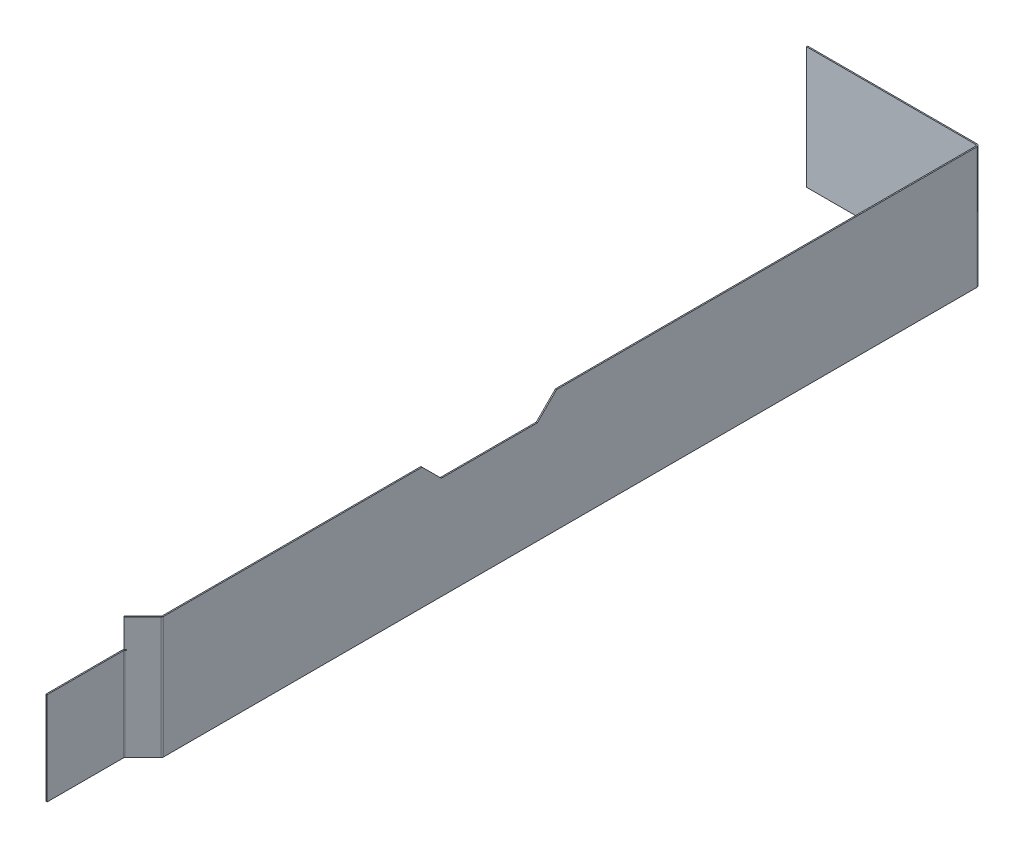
ISO-10303-21;
HEADER;
FILE_DESCRIPTION(('STEP AP214'),'2;1');
FILE_NAME('part.step','',(''),(''),'','','');
FILE_SCHEMA(('AUTOMOTIVE_DESIGN { 1 0 10303 214 1 1 1 1 }'));
ENDSEC;
DATA;
#1=APPLICATION_CONTEXT('core data for automotive mechanical design processes');
#2=APPLICATION_PROTOCOL_DEFINITION('international standard','automotive_design',2000,#1);
#3=PRODUCT_CONTEXT('',#1,'mechanical');
#4=PRODUCT('Part','Part','',(#3));
#5=PRODUCT_RELATED_PRODUCT_CATEGORY('part','',(#4));
#6=PRODUCT_DEFINITION_FORMATION('','',#4);
#7=PRODUCT_DEFINITION_CONTEXT('part definition',#1,'design');
#8=PRODUCT_DEFINITION('design','',#6,#7);
#9=PRODUCT_DEFINITION_SHAPE('','',#8);
#10=(LENGTH_UNIT() NAMED_UNIT(*) SI_UNIT(.MILLI.,.METRE.));
#11=(NAMED_UNIT(*) PLANE_ANGLE_UNIT() SI_UNIT($,.RADIAN.));
#12=(NAMED_UNIT(*) SI_UNIT($,.STERADIAN.) SOLID_ANGLE_UNIT());
#13=UNCERTAINTY_MEASURE_WITH_UNIT(LENGTH_MEASURE(1.E-05),#10,'distance_accuracy_value','');
#14=(GEOMETRIC_REPRESENTATION_CONTEXT(3) GLOBAL_UNCERTAINTY_ASSIGNED_CONTEXT((#13)) GLOBAL_UNIT_ASSIGNED_CONTEXT((#10,
#11,#12)) REPRESENTATION_CONTEXT('',''));
#15=CARTESIAN_POINT('',(0.,0.,0.));
#16=DIRECTION('',(0.,0.,1.));
#17=DIRECTION('',(1.,0.,0.));
#18=AXIS2_PLACEMENT_3D('',#15,#16,#17);
#19=CARTESIAN_POINT('',(-206.259115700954,1.45603603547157,-50.1060746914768));
#20=DIRECTION('',(0.,1.,0.));
#21=DIRECTION('',(-1.,0.,0.));
#22=AXIS2_PLACEMENT_3D('',#19,#20,#21);
#23=PLANE('',#22);
#24=DIRECTION('',(1.,0.,0.));
#25=VECTOR('',#24,1.);
#26=CARTESIAN_POINT('',(98.5408842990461,1.45603603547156,-48.5820746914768));
#27=LINE('',#26,#25);
#28=CARTESIAN_POINT('',(95.0102842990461,1.45603603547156,-48.5820746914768));
#29=VERTEX_POINT('',#28);
#30=CARTESIAN_POINT('',(-128.535115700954,1.45603603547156,-48.5820746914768));
#31=VERTEX_POINT('',#30);
#32=EDGE_CURVE('E190',#29,#31,#27,.F.);
#33=ORIENTED_EDGE('',*,*,#32,.T.);
#34=DIRECTION('',(0.,0.,1.));
#35=VECTOR('',#34,1.);
#36=CARTESIAN_POINT('',(-128.535115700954,1.45603603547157,-50.1060746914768));
#37=LINE('',#36,#35);
#38=CARTESIAN_POINT('',(-128.535115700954,1.45603603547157,-50.1060746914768));
#39=VERTEX_POINT('',#38);
#40=EDGE_CURVE('E54',#31,#39,#37,.F.);
#41=ORIENTED_EDGE('',*,*,#40,.T.);
#42=DIRECTION('',(-1.,0.,0.));
#43=VECTOR('',#42,1.);
#44=CARTESIAN_POINT('',(-206.259115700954,1.45603603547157,-50.1060746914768));
#45=LINE('',#44,#43);
#46=CARTESIAN_POINT('',(95.0102842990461,1.45603603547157,-50.1060746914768));
#47=VERTEX_POINT('',#46);
#48=EDGE_CURVE('E335',#47,#39,#45,.T.);
#49=ORIENTED_EDGE('',*,*,#48,.F.);
#50=DIRECTION('',(0.,0.,-1.));
#51=VECTOR('',#50,1.);
#52=CARTESIAN_POINT('',(95.0102842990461,1.45603603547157,-50.1060746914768));
#53=LINE('',#52,#51);
#54=EDGE_CURVE('E285',#29,#47,#53,.T.);
#55=ORIENTED_EDGE('',*,*,#54,.F.);
#56=EDGE_LOOP('',(#33,#41,#49,#55));
#57=FACE_BOUND('',#56,.T.);
#58=ADVANCED_FACE('F39',(#57),#23,.F.);
#59=CARTESIAN_POINT('',(98.5408842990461,162.314236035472,-50.1060746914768));
#60=DIRECTION('',(0.,1.,0.));
#61=DIRECTION('',(-1.,0.,0.));
#62=AXIS2_PLACEMENT_3D('',#59,#60,#61);
#63=PLANE('',#62);
#64=DIRECTION('',(-1.,0.,0.));
#65=VECTOR('',#64,1.);
#66=CARTESIAN_POINT('',(98.5408842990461,162.314236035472,-50.1060746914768));
#67=LINE('',#66,#65);
#68=CARTESIAN_POINT('',(95.0102842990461,162.314236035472,-50.1060746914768));
#69=VERTEX_POINT('',#68);
#70=CARTESIAN_POINT('',(-128.535115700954,162.314236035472,-50.1060746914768));
#71=VERTEX_POINT('',#70);
#72=EDGE_CURVE('E398',#69,#71,#67,.T.);
#73=ORIENTED_EDGE('',*,*,#72,.T.);
#74=DIRECTION('',(0.,0.,1.));
#75=VECTOR('',#74,1.);
#76=CARTESIAN_POINT('',(-128.535115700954,162.314236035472,-50.1060746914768));
#77=LINE('',#76,#75);
#78=CARTESIAN_POINT('',(-128.535115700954,162.314236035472,-48.5820746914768));
#79=VERTEX_POINT('',#78);
#80=EDGE_CURVE('E962',#71,#79,#77,.T.);
#81=ORIENTED_EDGE('',*,*,#80,.T.);
#82=DIRECTION('',(1.,0.,0.));
#83=VECTOR('',#82,1.);
#84=CARTESIAN_POINT('',(98.5408842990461,162.314236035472,-48.5820746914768));
#85=LINE('',#84,#83);
#86=CARTESIAN_POINT('',(95.0102842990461,162.314236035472,-48.5820746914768));
#87=VERTEX_POINT('',#86);
#88=EDGE_CURVE('E227',#87,#79,#85,.F.);
#89=ORIENTED_EDGE('',*,*,#88,.F.);
#90=DIRECTION('',(0.,0.,-1.));
#91=VECTOR('',#90,1.);
#92=CARTESIAN_POINT('',(95.0102842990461,162.314236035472,-50.1060746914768));
#93=LINE('',#92,#91);
#94=EDGE_CURVE('E282',#87,#69,#93,.T.);
#95=ORIENTED_EDGE('',*,*,#94,.T.);
#96=EDGE_LOOP('',(#73,#81,#89,#95));
#97=FACE_BOUND('',#96,.T.);
#98=ADVANCED_FACE('F395',(#97),#63,.T.);
#99=CARTESIAN_POINT('',(98.5408842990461,162.314236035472,-50.1060746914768));
#100=DIRECTION('',(0.,0.,1.));
#101=DIRECTION('',(1.,0.,0.));
#102=AXIS2_PLACEMENT_3D('',#99,#100,#101);
#103=PLANE('',#102);
#104=DIRECTION('',(0.,-1.,0.));
#105=VECTOR('',#104,1.);
#106=CARTESIAN_POINT('',(-128.535115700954,162.314236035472,-50.1060746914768));
#107=LINE('',#106,#105);
#108=EDGE_CURVE('E234',#71,#39,#107,.T.);
#109=ORIENTED_EDGE('',*,*,#108,.F.);
#110=ORIENTED_EDGE('',*,*,#72,.F.);
#111=DIRECTION('',(0.,-1.,0.));
#112=VECTOR('',#111,1.);
#113=CARTESIAN_POINT('',(95.0102842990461,162.314236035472,-50.1060746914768));
#114=LINE('',#113,#112);
#115=EDGE_CURVE('E340',#69,#47,#114,.T.);
#116=ORIENTED_EDGE('',*,*,#115,.T.);
#117=ORIENTED_EDGE('',*,*,#48,.T.);
#118=EDGE_LOOP('',(#109,#110,#116,#117));
#119=FACE_BOUND('',#118,.T.);
#120=ADVANCED_FACE('F401',(#119),#103,.F.);
#121=CARTESIAN_POINT('',(98.5408842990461,162.314236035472,-48.5820746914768));
#122=DIRECTION('',(0.,0.,1.));
#123=DIRECTION('',(1.,0.,0.));
#124=AXIS2_PLACEMENT_3D('',#121,#122,#123);
#125=PLANE('',#124);
#126=ORIENTED_EDGE('',*,*,#88,.T.);
#127=DIRECTION('',(0.,-1.,0.));
#128=VECTOR('',#127,1.);
#129=CARTESIAN_POINT('',(-128.535115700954,162.314236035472,-48.5820746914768));
#130=LINE('',#129,#128);
#131=EDGE_CURVE('E11',#79,#31,#130,.T.);
#132=ORIENTED_EDGE('',*,*,#131,.T.);
#133=ORIENTED_EDGE('',*,*,#32,.F.);
#134=DIRECTION('',(0.,1.,0.));
#135=VECTOR('',#134,1.);
#136=CARTESIAN_POINT('',(95.0102842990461,162.314236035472,-48.5820746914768));
#137=LINE('',#136,#135);
#138=EDGE_CURVE('E186',#87,#29,#137,.F.);
#139=ORIENTED_EDGE('',*,*,#138,.F.);
#140=EDGE_LOOP('',(#126,#132,#133,#139));
#141=FACE_BOUND('',#140,.T.);
#142=ADVANCED_FACE('F372',(#141),#125,.T.);
#143=CARTESIAN_POINT('',(73.1408842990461,1.45603603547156,1054.79392530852));
#144=DIRECTION('',(0.,1.,0.));
#145=DIRECTION('',(0.707106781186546,0.,-0.707106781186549));
#146=AXIS2_PLACEMENT_3D('',#143,#144,#145);
#147=PLANE('',#146);
#148=DIRECTION('',(0.707106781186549,0.,0.707106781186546));
#149=VECTOR('',#148,1.);
#150=CARTESIAN_POINT('',(73.7286038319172,1.45603603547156,1054.20620577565));
#151=LINE('',#150,#149);
#152=CARTESIAN_POINT('',(72.6509730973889,1.45603603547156,1053.12857504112));
#153=VERTEX_POINT('',#152);
#154=CARTESIAN_POINT('',(73.7286038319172,1.45603603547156,1054.20620577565));
#155=VERTEX_POINT('',#154);
#156=EDGE_CURVE('E47',#153,#155,#151,.T.);
#157=ORIENTED_EDGE('',*,*,#156,.F.);
#158=DIRECTION('',(-0.707106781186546,0.,0.707106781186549));
#159=VECTOR('',#158,1.);
#160=CARTESIAN_POINT('',(72.0632535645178,1.45603603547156,1053.71629457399));
#161=LINE('',#160,#159);
#162=CARTESIAN_POINT('',(96.4291647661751,1.45603603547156,1029.35038337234));
#163=VERTEX_POINT('',#162);
#164=EDGE_CURVE('E204',#153,#163,#161,.F.);
#165=ORIENTED_EDGE('',*,*,#164,.T.);
#166=DIRECTION('',(0.707106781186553,0.,0.707106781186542));
#167=VECTOR('',#166,1.);
#168=CARTESIAN_POINT('',(97.5067955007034,1.45603603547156,1030.42801410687));
#169=LINE('',#168,#167);
#170=CARTESIAN_POINT('',(97.5067955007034,1.45603603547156,1030.42801410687));
#171=VERTEX_POINT('',#170);
#172=EDGE_CURVE('E293',#163,#171,#169,.T.);
#173=ORIENTED_EDGE('',*,*,#172,.T.);
#174=DIRECTION('',(0.707106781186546,0.,-0.707106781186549));
#175=VECTOR('',#174,1.);
#176=CARTESIAN_POINT('',(73.1408842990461,1.45603603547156,1054.79392530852));
#177=LINE('',#176,#175);
#178=EDGE_CURVE('E313',#155,#171,#177,.T.);
#179=ORIENTED_EDGE('',*,*,#178,.F.);
#180=EDGE_LOOP('',(#157,#165,#173,#179));
#181=FACE_BOUND('',#180,.T.);
#182=ADVANCED_FACE('F314',(#181),#147,.F.);
#183=CARTESIAN_POINT('',(95.0102842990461,1.45603603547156,1027.93150290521));
#184=DIRECTION('',(0.,1.,0.));
#185=DIRECTION('',(0.,0.,1.));
#186=AXIS2_PLACEMENT_3D('',#183,#184,#185);
#187=PLANE('',#186);
#188=ORIENTED_EDGE('',*,*,#172,.F.);
#189=CARTESIAN_POINT('',(95.0102842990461,1.45603603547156,1027.93150290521));
#190=DIRECTION('',(0.,-1.,0.));
#191=DIRECTION('',(0.,0.,-1.));
#192=AXIS2_PLACEMENT_3D('',#189,#190,#191);
#193=CIRCLE('',#192,2.0066);
#194=CARTESIAN_POINT('',(97.0168842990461,1.45603603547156,1027.93150290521));
#195=VERTEX_POINT('',#194);
#196=EDGE_CURVE('E207',#163,#195,#193,.F.);
#197=ORIENTED_EDGE('',*,*,#196,.T.);
#198=DIRECTION('',(1.,0.,0.));
#199=VECTOR('',#198,1.);
#200=CARTESIAN_POINT('',(98.5408842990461,1.45603603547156,1027.93150290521));
#201=LINE('',#200,#199);
#202=CARTESIAN_POINT('',(98.5408842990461,1.45603603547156,1027.93150290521));
#203=VERTEX_POINT('',#202);
#204=EDGE_CURVE('E290',#195,#203,#201,.T.);
#205=ORIENTED_EDGE('',*,*,#204,.T.);
#206=CARTESIAN_POINT('',(95.0102842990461,1.45603603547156,1027.93150290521));
#207=DIRECTION('',(0.,-1.,0.));
#208=DIRECTION('',(0.,0.,-1.));
#209=AXIS2_PLACEMENT_3D('',#206,#207,#208);
#210=CIRCLE('',#209,3.5306);
#211=EDGE_CURVE('E341',#171,#203,#210,.F.);
#212=ORIENTED_EDGE('',*,*,#211,.F.);
#213=EDGE_LOOP('',(#188,#197,#205,#212));
#214=FACE_BOUND('',#213,.T.);
#215=ADVANCED_FACE('F522',(#214),#187,.F.);
#216=CARTESIAN_POINT('',(98.5408842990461,1.45603603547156,1029.39392530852));
#217=DIRECTION('',(0.,1.,0.));
#218=DIRECTION('',(0.,0.,-1.));
#219=AXIS2_PLACEMENT_3D('',#216,#217,#218);
#220=PLANE('',#219);
#221=ORIENTED_EDGE('',*,*,#204,.F.);
#222=DIRECTION('',(0.,0.,1.));
#223=VECTOR('',#222,1.);
#224=CARTESIAN_POINT('',(97.0168842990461,1.45603603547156,1029.39392530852));
#225=LINE('',#224,#223);
#226=CARTESIAN_POINT('',(97.0168842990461,1.45603603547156,-46.5754746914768));
#227=VERTEX_POINT('',#226);
#228=EDGE_CURVE('E223',#195,#227,#225,.F.);
#229=ORIENTED_EDGE('',*,*,#228,.T.);
#230=DIRECTION('',(1.,0.,0.));
#231=VECTOR('',#230,1.);
#232=CARTESIAN_POINT('',(98.5408842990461,1.45603603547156,-46.5754746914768));
#233=LINE('',#232,#231);
#234=CARTESIAN_POINT('',(98.5408842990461,1.45603603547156,-46.5754746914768));
#235=VERTEX_POINT('',#234);
#236=EDGE_CURVE('E288',#227,#235,#233,.T.);
#237=ORIENTED_EDGE('',*,*,#236,.T.);
#238=DIRECTION('',(0.,0.,-1.));
#239=VECTOR('',#238,1.);
#240=CARTESIAN_POINT('',(98.5408842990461,1.45603603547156,1029.39392530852));
#241=LINE('',#240,#239);
#242=EDGE_CURVE('E403',#203,#235,#241,.T.);
#243=ORIENTED_EDGE('',*,*,#242,.F.);
#244=EDGE_LOOP('',(#221,#229,#237,#243));
#245=FACE_BOUND('',#244,.T.);
#246=ADVANCED_FACE('F519',(#245),#220,.F.);
#247=CARTESIAN_POINT('',(95.0102842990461,1.45603603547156,-46.5754746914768));
#248=DIRECTION('',(0.,1.,0.));
#249=DIRECTION('',(0.,0.,1.));
#250=AXIS2_PLACEMENT_3D('',#247,#248,#249);
#251=PLANE('',#250);
#252=ORIENTED_EDGE('',*,*,#236,.F.);
#253=CARTESIAN_POINT('',(95.0102842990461,1.45603603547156,-46.5754746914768));
#254=DIRECTION('',(0.,-1.,0.));
#255=DIRECTION('',(0.,0.,-1.));
#256=AXIS2_PLACEMENT_3D('',#253,#254,#255);
#257=CIRCLE('',#256,2.0066);
#258=EDGE_CURVE('E226',#227,#29,#257,.F.);
#259=ORIENTED_EDGE('',*,*,#258,.T.);
#260=ORIENTED_EDGE('',*,*,#54,.T.);
#261=CARTESIAN_POINT('',(95.0102842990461,1.45603603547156,-46.5754746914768));
#262=DIRECTION('',(0.,-1.,0.));
#263=DIRECTION('',(0.,0.,-1.));
#264=AXIS2_PLACEMENT_3D('',#261,#262,#263);
#265=CIRCLE('',#264,3.5306);
#266=EDGE_CURVE('E351',#235,#47,#265,.F.);
#267=ORIENTED_EDGE('',*,*,#266,.F.);
#268=EDGE_LOOP('',(#252,#259,#260,#267));
#269=FACE_BOUND('',#268,.T.);
#270=ADVANCED_FACE('F375',(#269),#251,.F.);
#271=CARTESIAN_POINT('',(95.0102842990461,162.314236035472,-46.5754746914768));
#272=DIRECTION('',(0.,-1.,0.));
#273=DIRECTION('',(0.,0.,-1.));
#274=AXIS2_PLACEMENT_3D('',#271,#272,#273);
#275=PLANE('',#274);
#276=ORIENTED_EDGE('',*,*,#94,.F.);
#277=CARTESIAN_POINT('',(95.0102842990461,162.314236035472,-46.5754746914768));
#278=DIRECTION('',(0.,-1.,0.));
#279=DIRECTION('',(0.,0.,-1.));
#280=AXIS2_PLACEMENT_3D('',#277,#278,#279);
#281=CIRCLE('',#280,2.0066);
#282=CARTESIAN_POINT('',(97.0168842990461,162.314236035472,-46.5754746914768));
#283=VERTEX_POINT('',#282);
#284=EDGE_CURVE('E224',#87,#283,#281,.T.);
#285=ORIENTED_EDGE('',*,*,#284,.T.);
#286=DIRECTION('',(1.,0.,0.));
#287=VECTOR('',#286,1.);
#288=CARTESIAN_POINT('',(98.5408842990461,162.314236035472,-46.5754746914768));
#289=LINE('',#288,#287);
#290=CARTESIAN_POINT('',(98.5408842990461,162.314236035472,-46.5754746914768));
#291=VERTEX_POINT('',#290);
#292=EDGE_CURVE('E62',#283,#291,#289,.T.);
#293=ORIENTED_EDGE('',*,*,#292,.T.);
#294=CARTESIAN_POINT('',(95.0102842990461,162.314236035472,-46.5754746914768));
#295=DIRECTION('',(0.,1.,0.));
#296=DIRECTION('',(0.,0.,1.));
#297=AXIS2_PLACEMENT_3D('',#294,#295,#296);
#298=CIRCLE('',#297,3.5306);
#299=EDGE_CURVE('E344',#69,#291,#298,.F.);
#300=ORIENTED_EDGE('',*,*,#299,.F.);
#301=EDGE_LOOP('',(#276,#285,#293,#300));
#302=FACE_BOUND('',#301,.T.);
#303=ADVANCED_FACE('F390',(#302),#275,.F.);
#304=CARTESIAN_POINT('',(98.5408842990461,162.314236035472,1029.39392530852));
#305=DIRECTION('',(0.,1.,0.));
#306=DIRECTION('',(0.,0.,-1.));
#307=AXIS2_PLACEMENT_3D('',#304,#305,#306);
#308=PLANE('',#307);
#309=ORIENTED_EDGE('',*,*,#292,.F.);
#310=DIRECTION('',(0.,0.,1.));
#311=VECTOR('',#310,1.);
#312=CARTESIAN_POINT('',(97.0168842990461,162.314236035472,1029.39392530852));
#313=LINE('',#312,#311);
#314=CARTESIAN_POINT('',(97.0168842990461,162.314236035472,508.693925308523));
#315=VERTEX_POINT('',#314);
#316=EDGE_CURVE('E220',#315,#283,#313,.F.);
#317=ORIENTED_EDGE('',*,*,#316,.F.);
#318=DIRECTION('',(1.,0.,0.));
#319=VECTOR('',#318,1.);
#320=CARTESIAN_POINT('',(98.5408842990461,162.314236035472,508.693925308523));
#321=LINE('',#320,#319);
#322=CARTESIAN_POINT('',(98.5408842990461,162.314236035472,508.693925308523));
#323=VERTEX_POINT('',#322);
#324=EDGE_CURVE('E278',#315,#323,#321,.T.);
#325=ORIENTED_EDGE('',*,*,#324,.T.);
#326=DIRECTION('',(0.,0.,-1.));
#327=VECTOR('',#326,1.);
#328=CARTESIAN_POINT('',(98.5408842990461,162.314236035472,1029.39392530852));
#329=LINE('',#328,#327);
#330=EDGE_CURVE('E405',#323,#291,#329,.T.);
#331=ORIENTED_EDGE('',*,*,#330,.T.);
#332=EDGE_LOOP('',(#309,#317,#325,#331));
#333=FACE_BOUND('',#332,.T.);
#334=ADVANCED_FACE('F832',(#333),#308,.T.);
#335=CARTESIAN_POINT('',(98.5408842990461,-98.0357639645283,769.043925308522));
#336=DIRECTION('',(0.,-0.707106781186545,-0.70710678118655));
#337=DIRECTION('',(0.,-0.70710678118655,0.707106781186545));
#338=AXIS2_PLACEMENT_3D('',#335,#336,#337);
#339=PLANE('',#338);
#340=ORIENTED_EDGE('',*,*,#324,.F.);
#341=DIRECTION('',(0.,-0.70710678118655,0.707106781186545));
#342=VECTOR('',#341,1.);
#343=CARTESIAN_POINT('',(97.0168842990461,-98.0357639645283,769.043925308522));
#344=LINE('',#343,#342);
#345=CARTESIAN_POINT('',(97.0168842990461,136.914236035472,534.093925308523));
#346=VERTEX_POINT('',#345);
#347=EDGE_CURVE('E217',#315,#346,#344,.T.);
#348=ORIENTED_EDGE('',*,*,#347,.T.);
#349=DIRECTION('',(1.,0.,0.));
#350=VECTOR('',#349,1.);
#351=CARTESIAN_POINT('',(98.540884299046,136.914236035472,534.093925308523));
#352=LINE('',#351,#350);
#353=CARTESIAN_POINT('',(98.540884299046,136.914236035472,534.093925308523));
#354=VERTEX_POINT('',#353);
#355=EDGE_CURVE('E275',#346,#354,#352,.T.);
#356=ORIENTED_EDGE('',*,*,#355,.T.);
#357=DIRECTION('',(0.,-0.70710678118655,0.707106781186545));
#358=VECTOR('',#357,1.);
#359=CARTESIAN_POINT('',(98.5408842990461,-98.0357639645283,769.043925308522));
#360=LINE('',#359,#358);
#361=EDGE_CURVE('E412',#323,#354,#360,.T.);
#362=ORIENTED_EDGE('',*,*,#361,.F.);
#363=EDGE_LOOP('',(#340,#348,#356,#362));
#364=FACE_BOUND('',#363,.T.);
#365=ADVANCED_FACE('F855',(#364),#339,.F.);
#366=CARTESIAN_POINT('',(98.5408842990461,136.914236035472,1029.39392530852));
#367=DIRECTION('',(0.,-1.,0.));
#368=DIRECTION('',(0.,0.,1.));
#369=AXIS2_PLACEMENT_3D('',#366,#367,#368);
#370=PLANE('',#369);
#371=ORIENTED_EDGE('',*,*,#355,.F.);
#372=DIRECTION('',(0.,0.,1.));
#373=VECTOR('',#372,1.);
#374=CARTESIAN_POINT('',(97.0168842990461,136.914236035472,1029.39392530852));
#375=LINE('',#374,#373);
#376=CARTESIAN_POINT('',(97.0168842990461,136.914236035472,661.093925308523));
#377=VERTEX_POINT('',#376);
#378=EDGE_CURVE('E214',#346,#377,#375,.T.);
#379=ORIENTED_EDGE('',*,*,#378,.T.);
#380=DIRECTION('',(1.,0.,0.));
#381=VECTOR('',#380,1.);
#382=CARTESIAN_POINT('',(98.540884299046,136.914236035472,661.093925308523));
#383=LINE('',#382,#381);
#384=CARTESIAN_POINT('',(98.540884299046,136.914236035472,661.093925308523));
#385=VERTEX_POINT('',#384);
#386=EDGE_CURVE('E272',#377,#385,#383,.T.);
#387=ORIENTED_EDGE('',*,*,#386,.T.);
#388=DIRECTION('',(0.,0.,1.));
#389=VECTOR('',#388,1.);
#390=CARTESIAN_POINT('',(98.5408842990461,136.914236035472,1029.39392530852));
#391=LINE('',#390,#389);
#392=EDGE_CURVE('E415',#354,#385,#391,.T.);
#393=ORIENTED_EDGE('',*,*,#392,.F.);
#394=EDGE_LOOP('',(#371,#379,#387,#393));
#395=FACE_BOUND('',#394,.T.);
#396=ADVANCED_FACE('F842',(#395),#370,.F.);
#397=CARTESIAN_POINT('',(98.5408842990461,333.764236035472,857.943925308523));
#398=DIRECTION('',(0.,-0.707106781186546,0.707106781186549));
#399=DIRECTION('',(0.,0.707106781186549,0.707106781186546));
#400=AXIS2_PLACEMENT_3D('',#397,#398,#399);
#401=PLANE('',#400);
#402=ORIENTED_EDGE('',*,*,#386,.F.);
#403=DIRECTION('',(0.,0.707106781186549,0.707106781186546));
#404=VECTOR('',#403,1.);
#405=CARTESIAN_POINT('',(97.0168842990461,333.764236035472,857.943925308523));
#406=LINE('',#405,#404);
#407=CARTESIAN_POINT('',(97.0168842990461,162.314236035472,686.493925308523));
#408=VERTEX_POINT('',#407);
#409=EDGE_CURVE('E211',#377,#408,#406,.T.);
#410=ORIENTED_EDGE('',*,*,#409,.T.);
#411=DIRECTION('',(1.,0.,0.));
#412=VECTOR('',#411,1.);
#413=CARTESIAN_POINT('',(98.5408842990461,162.314236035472,686.493925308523));
#414=LINE('',#413,#412);
#415=CARTESIAN_POINT('',(98.5408842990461,162.314236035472,686.493925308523));
#416=VERTEX_POINT('',#415);
#417=EDGE_CURVE('E269',#408,#416,#414,.T.);
#418=ORIENTED_EDGE('',*,*,#417,.T.);
#419=DIRECTION('',(0.,0.707106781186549,0.707106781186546));
#420=VECTOR('',#419,1.);
#421=CARTESIAN_POINT('',(98.5408842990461,333.764236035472,857.943925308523));
#422=LINE('',#421,#420);
#423=EDGE_CURVE('E418',#385,#416,#422,.T.);
#424=ORIENTED_EDGE('',*,*,#423,.F.);
#425=EDGE_LOOP('',(#402,#410,#418,#424));
#426=FACE_BOUND('',#425,.T.);
#427=ADVANCED_FACE('F829',(#426),#401,.F.);
#428=ORIENTED_EDGE('',*,*,#417,.F.);
#429=DIRECTION('',(0.,0.,1.));
#430=VECTOR('',#429,1.);
#431=CARTESIAN_POINT('',(97.0168842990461,162.314236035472,1029.39392530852));
#432=LINE('',#431,#430);
#433=CARTESIAN_POINT('',(97.0168842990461,162.314236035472,1027.93150290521));
#434=VERTEX_POINT('',#433);
#435=EDGE_CURVE('E208',#434,#408,#432,.F.);
#436=ORIENTED_EDGE('',*,*,#435,.F.);
#437=DIRECTION('',(1.,0.,0.));
#438=VECTOR('',#437,1.);
#439=CARTESIAN_POINT('',(98.5408842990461,162.314236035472,1027.93150290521));
#440=LINE('',#439,#438);
#441=CARTESIAN_POINT('',(98.5408842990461,162.314236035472,1027.93150290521));
#442=VERTEX_POINT('',#441);
#443=EDGE_CURVE('E266',#434,#442,#440,.T.);
#444=ORIENTED_EDGE('',*,*,#443,.T.);
#445=EDGE_CURVE('E320',#442,#416,#329,.T.);
#446=ORIENTED_EDGE('',*,*,#445,.T.);
#447=EDGE_LOOP('',(#428,#436,#444,#446));
#448=FACE_BOUND('',#447,.T.);
#449=ADVANCED_FACE('F819',(#448),#308,.T.);
#450=CARTESIAN_POINT('',(95.0102842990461,162.314236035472,1027.93150290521));
#451=DIRECTION('',(0.,-1.,0.));
#452=DIRECTION('',(0.,0.,-1.));
#453=AXIS2_PLACEMENT_3D('',#450,#451,#452);
#454=PLANE('',#453);
#455=ORIENTED_EDGE('',*,*,#443,.F.);
#456=CARTESIAN_POINT('',(95.0102842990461,162.314236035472,1027.93150290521));
#457=DIRECTION('',(0.,-1.,0.));
#458=DIRECTION('',(0.,0.,-1.));
#459=AXIS2_PLACEMENT_3D('',#456,#457,#458);
#460=CIRCLE('',#459,2.0066);
#461=CARTESIAN_POINT('',(96.429164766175,162.314236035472,1029.35038337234));
#462=VERTEX_POINT('',#461);
#463=EDGE_CURVE('E175',#434,#462,#460,.T.);
#464=ORIENTED_EDGE('',*,*,#463,.T.);
#465=DIRECTION('',(0.707106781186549,0.,0.707106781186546));
#466=VECTOR('',#465,1.);
#467=CARTESIAN_POINT('',(97.5067955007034,162.314236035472,1030.42801410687));
#468=LINE('',#467,#466);
#469=CARTESIAN_POINT('',(97.5067955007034,162.314236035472,1030.42801410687));
#470=VERTEX_POINT('',#469);
#471=EDGE_CURVE('E263',#462,#470,#468,.T.);
#472=ORIENTED_EDGE('',*,*,#471,.T.);
#473=CARTESIAN_POINT('',(95.0102842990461,162.314236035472,1027.93150290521));
#474=DIRECTION('',(0.,1.,0.));
#475=DIRECTION('',(0.,0.,1.));
#476=AXIS2_PLACEMENT_3D('',#473,#474,#475);
#477=CIRCLE('',#476,3.5306);
#478=EDGE_CURVE('E310',#442,#470,#477,.F.);
#479=ORIENTED_EDGE('',*,*,#478,.F.);
#480=EDGE_LOOP('',(#455,#464,#472,#479));
#481=FACE_BOUND('',#480,.T.);
#482=ADVANCED_FACE('F480',(#481),#454,.F.);
#483=CARTESIAN_POINT('',(73.1408842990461,162.314236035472,1054.79392530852));
#484=DIRECTION('',(0.,1.,0.));
#485=DIRECTION('',(0.707106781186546,0.,-0.707106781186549));
#486=AXIS2_PLACEMENT_3D('',#483,#484,#485);
#487=PLANE('',#486);
#488=ORIENTED_EDGE('',*,*,#471,.F.);
#489=DIRECTION('',(-0.707106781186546,0.,0.707106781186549));
#490=VECTOR('',#489,1.);
#491=CARTESIAN_POINT('',(72.0632535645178,162.314236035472,1053.71629457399));
#492=LINE('',#491,#490);
#493=CARTESIAN_POINT('',(72.0632535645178,162.314236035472,1053.71629457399));
#494=VERTEX_POINT('',#493);
#495=EDGE_CURVE('E201',#494,#462,#492,.F.);
#496=ORIENTED_EDGE('',*,*,#495,.F.);
#497=DIRECTION('',(0.707106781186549,0.,0.707106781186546));
#498=VECTOR('',#497,1.);
#499=CARTESIAN_POINT('',(73.1408842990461,162.314236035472,1054.79392530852));
#500=LINE('',#499,#498);
#501=CARTESIAN_POINT('',(73.1408842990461,162.314236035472,1054.79392530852));
#502=VERTEX_POINT('',#501);
#503=EDGE_CURVE('E260',#494,#502,#500,.T.);
#504=ORIENTED_EDGE('',*,*,#503,.T.);
#505=DIRECTION('',(0.707106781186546,0.,-0.707106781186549));
#506=VECTOR('',#505,1.);
#507=CARTESIAN_POINT('',(73.1408842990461,162.314236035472,1054.79392530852));
#508=LINE('',#507,#506);
#509=EDGE_CURVE('E319',#502,#470,#508,.T.);
#510=ORIENTED_EDGE('',*,*,#509,.T.);
#511=EDGE_LOOP('',(#488,#496,#504,#510));
#512=FACE_BOUND('',#511,.T.);
#513=ADVANCED_FACE('F489',(#512),#487,.T.);
#514=CARTESIAN_POINT('',(73.1408842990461,162.314236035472,1054.79392530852));
#515=DIRECTION('',(0.707106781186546,0.,-0.707106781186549));
#516=DIRECTION('',(0.,-1.,0.));
#517=AXIS2_PLACEMENT_3D('',#514,#515,#516);
#518=PLANE('',#517);
#519=ORIENTED_EDGE('',*,*,#503,.F.);
#520=DIRECTION('',(0.,1.,0.));
#521=VECTOR('',#520,1.);
#522=CARTESIAN_POINT('',(72.0632535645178,162.314236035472,1053.71629457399));
#523=LINE('',#522,#521);
#524=CARTESIAN_POINT('',(72.0632535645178,124.976236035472,1053.71629457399));
#525=VERTEX_POINT('',#524);
#526=EDGE_CURVE('E183',#494,#525,#523,.F.);
#527=ORIENTED_EDGE('',*,*,#526,.T.);
#528=DIRECTION('',(0.707106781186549,0.,0.707106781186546));
#529=VECTOR('',#528,1.);
#530=CARTESIAN_POINT('',(73.1408842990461,124.976236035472,1054.79392530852));
#531=LINE('',#530,#529);
#532=CARTESIAN_POINT('',(73.1408842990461,124.976236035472,1054.79392530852));
#533=VERTEX_POINT('',#532);
#534=EDGE_CURVE('E257',#525,#533,#531,.T.);
#535=ORIENTED_EDGE('',*,*,#534,.T.);
#536=DIRECTION('',(0.,-1.,0.));
#537=VECTOR('',#536,1.);
#538=CARTESIAN_POINT('',(73.1408842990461,162.314236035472,1054.79392530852));
#539=LINE('',#538,#537);
#540=EDGE_CURVE('E421',#502,#533,#539,.T.);
#541=ORIENTED_EDGE('',*,*,#540,.F.);
#542=EDGE_LOOP('',(#519,#527,#535,#541));
#543=FACE_BOUND('',#542,.T.);
#544=ADVANCED_FACE('F492',(#543),#518,.F.);
#545=CARTESIAN_POINT('',(73.1408842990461,124.976236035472,1054.79392530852));
#546=DIRECTION('',(0.,1.,0.));
#547=DIRECTION('',(0.707106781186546,0.,-0.707106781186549));
#548=AXIS2_PLACEMENT_3D('',#545,#546,#547);
#549=PLANE('',#548);
#550=ORIENTED_EDGE('',*,*,#534,.F.);
#551=DIRECTION('',(-0.707106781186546,0.,0.707106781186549));
#552=VECTOR('',#551,1.);
#553=CARTESIAN_POINT('',(72.0632535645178,124.976236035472,1053.71629457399));
#554=LINE('',#553,#552);
#555=CARTESIAN_POINT('',(73.6361577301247,124.976236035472,1052.14339040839));
#556=VERTEX_POINT('',#555);
#557=EDGE_CURVE('E181',#525,#556,#554,.F.);
#558=ORIENTED_EDGE('',*,*,#557,.T.);
#559=DIRECTION('',(0.707106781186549,0.,0.707106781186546));
#560=VECTOR('',#559,1.);
#561=CARTESIAN_POINT('',(74.713788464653,124.976236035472,1053.22102114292));
#562=LINE('',#561,#560);
#563=CARTESIAN_POINT('',(74.713788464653,124.976236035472,1053.22102114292));
#564=VERTEX_POINT('',#563);
#565=EDGE_CURVE('E254',#556,#564,#562,.T.);
#566=ORIENTED_EDGE('',*,*,#565,.T.);
#567=DIRECTION('',(0.707106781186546,0.,-0.707106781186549));
#568=VECTOR('',#567,1.);
#569=CARTESIAN_POINT('',(73.1408842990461,124.976236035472,1054.79392530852));
#570=LINE('',#569,#568);
#571=EDGE_CURVE('E434',#533,#564,#570,.T.);
#572=ORIENTED_EDGE('',*,*,#571,.F.);
#573=EDGE_LOOP('',(#550,#558,#566,#572));
#574=FACE_BOUND('',#573,.T.);
#575=ADVANCED_FACE('F496',(#574),#549,.F.);
#576=CARTESIAN_POINT('',(74.713788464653,162.314236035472,1053.22102114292));
#577=DIRECTION('',(0.707106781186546,0.,-0.707106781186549));
#578=DIRECTION('',(0.,-1.,0.));
#579=AXIS2_PLACEMENT_3D('',#576,#577,#578);
#580=PLANE('',#579);
#581=ORIENTED_EDGE('',*,*,#565,.F.);
#582=DIRECTION('',(0.,1.,0.));
#583=VECTOR('',#582,1.);
#584=CARTESIAN_POINT('',(73.6361577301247,162.314236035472,1052.14339040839));
#585=LINE('',#584,#583);
#586=CARTESIAN_POINT('',(73.6361577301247,124.214236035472,1052.14339040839));
#587=VERTEX_POINT('',#586);
#588=EDGE_CURVE('E194',#556,#587,#585,.F.);
#589=ORIENTED_EDGE('',*,*,#588,.T.);
#590=DIRECTION('',(0.707106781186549,0.,0.707106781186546));
#591=VECTOR('',#590,1.);
#592=CARTESIAN_POINT('',(74.713788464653,124.214236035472,1053.22102114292));
#593=LINE('',#592,#591);
#594=CARTESIAN_POINT('',(74.713788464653,124.214236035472,1053.22102114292));
#595=VERTEX_POINT('',#594);
#596=EDGE_CURVE('E251',#587,#595,#593,.T.);
#597=ORIENTED_EDGE('',*,*,#596,.T.);
#598=DIRECTION('',(0.,-1.,0.));
#599=VECTOR('',#598,1.);
#600=CARTESIAN_POINT('',(74.713788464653,162.314236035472,1053.22102114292));
#601=LINE('',#600,#599);
#602=EDGE_CURVE('E330',#564,#595,#601,.T.);
#603=ORIENTED_EDGE('',*,*,#602,.F.);
#604=EDGE_LOOP('',(#581,#589,#597,#603));
#605=FACE_BOUND('',#604,.T.);
#606=ADVANCED_FACE('F500',(#605),#580,.F.);
#607=CARTESIAN_POINT('',(73.1408842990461,124.214236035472,1054.79392530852));
#608=DIRECTION('',(0.,-1.,0.));
#609=DIRECTION('',(-0.707106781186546,0.,0.707106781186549));
#610=AXIS2_PLACEMENT_3D('',#607,#608,#609);
#611=PLANE('',#610);
#612=ORIENTED_EDGE('',*,*,#596,.F.);
#613=DIRECTION('',(-0.707106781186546,0.,0.707106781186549));
#614=VECTOR('',#613,1.);
#615=CARTESIAN_POINT('',(72.0632535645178,124.214236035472,1053.71629457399));
#616=LINE('',#615,#614);
#617=CARTESIAN_POINT('',(72.650973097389,124.214236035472,1053.12857504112));
#618=VERTEX_POINT('',#617);
#619=EDGE_CURVE('E191',#587,#618,#616,.T.);
#620=ORIENTED_EDGE('',*,*,#619,.T.);
#621=DIRECTION('',(0.70710678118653,0.,0.707106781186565));
#622=VECTOR('',#621,1.);
#623=CARTESIAN_POINT('',(73.7286038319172,124.214236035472,1054.20620577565));
#624=LINE('',#623,#622);
#625=CARTESIAN_POINT('',(73.7286038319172,124.214236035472,1054.20620577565));
#626=VERTEX_POINT('',#625);
#627=EDGE_CURVE('E248',#618,#626,#624,.T.);
#628=ORIENTED_EDGE('',*,*,#627,.T.);
#629=DIRECTION('',(-0.707106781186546,0.,0.707106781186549));
#630=VECTOR('',#629,1.);
#631=CARTESIAN_POINT('',(73.1408842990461,124.214236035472,1054.79392530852));
#632=LINE('',#631,#630);
#633=EDGE_CURVE('E326',#595,#626,#632,.T.);
#634=ORIENTED_EDGE('',*,*,#633,.F.);
#635=EDGE_LOOP('',(#612,#620,#628,#634));
#636=FACE_BOUND('',#635,.T.);
#637=ADVANCED_FACE('F443',(#636),#611,.F.);
#638=CARTESIAN_POINT('',(75.1474842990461,124.214236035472,1055.62508624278));
#639=DIRECTION('',(0.,-1.,0.));
#640=DIRECTION('',(1.,0.,0.));
#641=AXIS2_PLACEMENT_3D('',#638,#639,#640);
#642=PLANE('',#641);
#643=ORIENTED_EDGE('',*,*,#627,.F.);
#644=CARTESIAN_POINT('',(75.1474842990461,124.214236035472,1055.62508624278));
#645=DIRECTION('',(0.,1.,0.));
#646=DIRECTION('',(0.,0.,1.));
#647=AXIS2_PLACEMENT_3D('',#644,#645,#646);
#648=CIRCLE('',#647,3.5306);
#649=CARTESIAN_POINT('',(71.6168842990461,124.214236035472,1055.62508624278));
#650=VERTEX_POINT('',#649);
#651=EDGE_CURVE('E174',#618,#650,#648,.T.);
#652=ORIENTED_EDGE('',*,*,#651,.T.);
#653=DIRECTION('',(1.,0.,0.));
#654=VECTOR('',#653,1.);
#655=CARTESIAN_POINT('',(73.1408842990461,124.214236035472,1055.62508624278));
#656=LINE('',#655,#654);
#657=CARTESIAN_POINT('',(73.1408842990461,124.214236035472,1055.62508624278));
#658=VERTEX_POINT('',#657);
#659=EDGE_CURVE('E245',#650,#658,#656,.T.);
#660=ORIENTED_EDGE('',*,*,#659,.T.);
#661=CARTESIAN_POINT('',(75.1474842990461,124.214236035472,1055.62508624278));
#662=DIRECTION('',(0.,1.,0.));
#663=DIRECTION('',(-1.,0.,0.));
#664=AXIS2_PLACEMENT_3D('',#661,#662,#663);
#665=CIRCLE('',#664,2.0066);
#666=EDGE_CURVE('E309',#626,#658,#665,.T.);
#667=ORIENTED_EDGE('',*,*,#666,.F.);
#668=EDGE_LOOP('',(#643,#652,#660,#667));
#669=FACE_BOUND('',#668,.T.);
#670=ADVANCED_FACE('F448',(#669),#642,.F.);
#671=CARTESIAN_POINT('',(73.1408842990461,124.214236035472,1156.39392530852));
#672=DIRECTION('',(0.,1.,0.));
#673=DIRECTION('',(0.,0.,-1.));
#674=AXIS2_PLACEMENT_3D('',#671,#672,#673);
#675=PLANE('',#674);
#676=ORIENTED_EDGE('',*,*,#659,.F.);
#677=DIRECTION('',(0.,0.,1.));
#678=VECTOR('',#677,1.);
#679=CARTESIAN_POINT('',(71.6168842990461,124.214236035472,1156.39392530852));
#680=LINE('',#679,#678);
#681=CARTESIAN_POINT('',(71.6168842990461,124.214236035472,1156.39392530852));
#682=VERTEX_POINT('',#681);
#683=EDGE_CURVE('E163',#682,#650,#680,.F.);
#684=ORIENTED_EDGE('',*,*,#683,.F.);
#685=DIRECTION('',(1.,0.,0.));
#686=VECTOR('',#685,1.);
#687=CARTESIAN_POINT('',(73.1408842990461,124.214236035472,1156.39392530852));
#688=LINE('',#687,#686);
#689=CARTESIAN_POINT('',(73.1408842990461,124.214236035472,1156.39392530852));
#690=VERTEX_POINT('',#689);
#691=EDGE_CURVE('E242',#682,#690,#688,.T.);
#692=ORIENTED_EDGE('',*,*,#691,.T.);
#693=DIRECTION('',(0.,0.,-1.));
#694=VECTOR('',#693,1.);
#695=CARTESIAN_POINT('',(73.1408842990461,124.214236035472,1156.39392530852));
#696=LINE('',#695,#694);
#697=EDGE_CURVE('E431',#690,#658,#696,.T.);
#698=ORIENTED_EDGE('',*,*,#697,.T.);
#699=EDGE_LOOP('',(#676,#684,#692,#698));
#700=FACE_BOUND('',#699,.T.);
#701=ADVANCED_FACE('F454',(#700),#675,.T.);
#702=CARTESIAN_POINT('',(73.1408842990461,162.314236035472,1156.39392530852));
#703=DIRECTION('',(0.,0.,-1.));
#704=DIRECTION('',(0.,-1.,0.));
#705=AXIS2_PLACEMENT_3D('',#702,#703,#704);
#706=PLANE('',#705);
#707=ORIENTED_EDGE('',*,*,#691,.F.);
#708=DIRECTION('',(0.,1.,0.));
#709=VECTOR('',#708,1.);
#710=CARTESIAN_POINT('',(71.6168842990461,162.314236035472,1156.39392530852));
#711=LINE('',#710,#709);
#712=CARTESIAN_POINT('',(71.6168842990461,1.45603603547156,1156.39392530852));
#713=VERTEX_POINT('',#712);
#714=EDGE_CURVE('E179',#682,#713,#711,.F.);
#715=ORIENTED_EDGE('',*,*,#714,.T.);
#716=DIRECTION('',(1.,0.,0.));
#717=VECTOR('',#716,1.);
#718=CARTESIAN_POINT('',(73.1408842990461,1.45603603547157,1156.39392530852));
#719=LINE('',#718,#717);
#720=CARTESIAN_POINT('',(73.1408842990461,1.45603603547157,1156.39392530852));
#721=VERTEX_POINT('',#720);
#722=EDGE_CURVE('E151',#713,#721,#719,.T.);
#723=ORIENTED_EDGE('',*,*,#722,.T.);
#724=DIRECTION('',(0.,-1.,0.));
#725=VECTOR('',#724,1.);
#726=CARTESIAN_POINT('',(73.1408842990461,162.314236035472,1156.39392530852));
#727=LINE('',#726,#725);
#728=EDGE_CURVE('E423',#690,#721,#727,.T.);
#729=ORIENTED_EDGE('',*,*,#728,.F.);
#730=EDGE_LOOP('',(#707,#715,#723,#729));
#731=FACE_BOUND('',#730,.T.);
#732=ADVANCED_FACE('F548',(#731),#706,.F.);
#733=CARTESIAN_POINT('',(73.1408842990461,1.45603603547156,1156.39392530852));
#734=DIRECTION('',(0.,1.,0.));
#735=DIRECTION('',(0.,0.,-1.));
#736=AXIS2_PLACEMENT_3D('',#733,#734,#735);
#737=PLANE('',#736);
#738=ORIENTED_EDGE('',*,*,#722,.F.);
#739=DIRECTION('',(0.,0.,1.));
#740=VECTOR('',#739,1.);
#741=CARTESIAN_POINT('',(71.6168842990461,1.45603603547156,1156.39392530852));
#742=LINE('',#741,#740);
#743=CARTESIAN_POINT('',(71.6168842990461,1.45603603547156,1055.62508624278));
#744=VERTEX_POINT('',#743);
#745=EDGE_CURVE('E160',#713,#744,#742,.F.);
#746=ORIENTED_EDGE('',*,*,#745,.T.);
#747=DIRECTION('',(1.,0.,0.));
#748=VECTOR('',#747,1.);
#749=CARTESIAN_POINT('',(73.1408842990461,1.45603603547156,1055.62508624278));
#750=LINE('',#749,#748);
#751=CARTESIAN_POINT('',(73.1408842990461,1.45603603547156,1055.62508624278));
#752=VERTEX_POINT('',#751);
#753=EDGE_CURVE('E138',#744,#752,#750,.T.);
#754=ORIENTED_EDGE('',*,*,#753,.T.);
#755=DIRECTION('',(0.,0.,-1.));
#756=VECTOR('',#755,1.);
#757=CARTESIAN_POINT('',(73.1408842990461,1.45603603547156,1156.39392530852));
#758=LINE('',#757,#756);
#759=EDGE_CURVE('E429',#721,#752,#758,.T.);
#760=ORIENTED_EDGE('',*,*,#759,.F.);
#761=EDGE_LOOP('',(#738,#746,#754,#760));
#762=FACE_BOUND('',#761,.T.);
#763=ADVANCED_FACE('F177',(#762),#737,.F.);
#764=CARTESIAN_POINT('',(75.1474842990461,1.45603603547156,1055.62508624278));
#765=DIRECTION('',(0.,-1.,0.));
#766=DIRECTION('',(0.,0.,-1.));
#767=AXIS2_PLACEMENT_3D('',#764,#765,#766);
#768=PLANE('',#767);
#769=CARTESIAN_POINT('',(75.1474842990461,1.45603603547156,1055.62508624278));
#770=DIRECTION('',(0.,1.,0.));
#771=DIRECTION('',(0.,0.,1.));
#772=AXIS2_PLACEMENT_3D('',#769,#770,#771);
#773=CIRCLE('',#772,3.5306);
#774=EDGE_CURVE('E142',#744,#153,#773,.F.);
#775=ORIENTED_EDGE('',*,*,#774,.T.);
#776=ORIENTED_EDGE('',*,*,#156,.T.);
#777=CARTESIAN_POINT('',(75.1474842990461,1.45603603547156,1055.62508624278));
#778=DIRECTION('',(0.,1.,0.));
#779=DIRECTION('',(0.,0.,1.));
#780=AXIS2_PLACEMENT_3D('',#777,#778,#779);
#781=CIRCLE('',#780,2.0066);
#782=EDGE_CURVE('E145',#752,#155,#781,.F.);
#783=ORIENTED_EDGE('',*,*,#782,.F.);
#784=ORIENTED_EDGE('',*,*,#753,.F.);
#785=EDGE_LOOP('',(#775,#776,#783,#784));
#786=FACE_BOUND('',#785,.T.);
#787=ADVANCED_FACE('F41',(#786),#768,.T.);
#788=CARTESIAN_POINT('',(73.1408842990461,162.314236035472,1156.39392530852));
#789=DIRECTION('',(-1.,0.,0.));
#790=DIRECTION('',(0.,0.,1.));
#791=AXIS2_PLACEMENT_3D('',#788,#789,#790);
#792=PLANE('',#791);
#793=ORIENTED_EDGE('',*,*,#759,.T.);
#794=DIRECTION('',(0.,-1.,0.));
#795=VECTOR('',#794,1.);
#796=CARTESIAN_POINT('',(73.1408842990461,124.214236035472,1055.62508624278));
#797=LINE('',#796,#795);
#798=EDGE_CURVE('E308',#752,#658,#797,.F.);
#799=ORIENTED_EDGE('',*,*,#798,.T.);
#800=ORIENTED_EDGE('',*,*,#697,.F.);
#801=ORIENTED_EDGE('',*,*,#728,.T.);
#802=EDGE_LOOP('',(#793,#799,#800,#801));
#803=FACE_BOUND('',#802,.T.);
#804=ADVANCED_FACE('F458',(#803),#792,.F.);
#805=CARTESIAN_POINT('',(73.1408842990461,162.314236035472,1054.79392530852));
#806=DIRECTION('',(-0.707106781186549,0.,-0.707106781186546));
#807=DIRECTION('',(-0.707106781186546,0.,0.707106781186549));
#808=AXIS2_PLACEMENT_3D('',#805,#806,#807);
#809=PLANE('',#808);
#810=ORIENTED_EDGE('',*,*,#178,.T.);
#811=DIRECTION('',(0.,-1.,0.));
#812=VECTOR('',#811,1.);
#813=CARTESIAN_POINT('',(97.5067955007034,162.314236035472,1030.42801410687));
#814=LINE('',#813,#812);
#815=EDGE_CURVE('E338',#171,#470,#814,.F.);
#816=ORIENTED_EDGE('',*,*,#815,.T.);
#817=ORIENTED_EDGE('',*,*,#509,.F.);
#818=ORIENTED_EDGE('',*,*,#540,.T.);
#819=ORIENTED_EDGE('',*,*,#571,.T.);
#820=ORIENTED_EDGE('',*,*,#602,.T.);
#821=ORIENTED_EDGE('',*,*,#633,.T.);
#822=DIRECTION('',(0.,-1.,0.));
#823=VECTOR('',#822,1.);
#824=CARTESIAN_POINT('',(73.7286038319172,1.45603603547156,1054.20620577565));
#825=LINE('',#824,#823);
#826=EDGE_CURVE('E306',#626,#155,#825,.T.);
#827=ORIENTED_EDGE('',*,*,#826,.T.);
#828=EDGE_LOOP('',(#810,#816,#817,#818,#819,#820,#821,#827));
#829=FACE_BOUND('',#828,.T.);
#830=ADVANCED_FACE('F323',(#829),#809,.F.);
#831=CARTESIAN_POINT('',(98.5408842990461,162.314236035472,1029.39392530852));
#832=DIRECTION('',(-1.,0.,0.));
#833=DIRECTION('',(0.,0.,1.));
#834=AXIS2_PLACEMENT_3D('',#831,#832,#833);
#835=PLANE('',#834);
#836=ORIENTED_EDGE('',*,*,#242,.T.);
#837=DIRECTION('',(0.,-1.,0.));
#838=VECTOR('',#837,1.);
#839=CARTESIAN_POINT('',(98.5408842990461,162.314236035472,-46.5754746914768));
#840=LINE('',#839,#838);
#841=EDGE_CURVE('E152',#235,#291,#840,.F.);
#842=ORIENTED_EDGE('',*,*,#841,.T.);
#843=ORIENTED_EDGE('',*,*,#330,.F.);
#844=ORIENTED_EDGE('',*,*,#361,.T.);
#845=ORIENTED_EDGE('',*,*,#392,.T.);
#846=ORIENTED_EDGE('',*,*,#423,.T.);
#847=ORIENTED_EDGE('',*,*,#445,.F.);
#848=DIRECTION('',(0.,-1.,0.));
#849=VECTOR('',#848,1.);
#850=CARTESIAN_POINT('',(98.5408842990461,162.314236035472,1027.93150290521));
#851=LINE('',#850,#849);
#852=EDGE_CURVE('E328',#442,#203,#851,.T.);
#853=ORIENTED_EDGE('',*,*,#852,.T.);
#854=EDGE_LOOP('',(#836,#842,#843,#844,#845,#846,#847,#853));
#855=FACE_BOUND('',#854,.T.);
#856=ADVANCED_FACE('F587',(#855),#835,.F.);
#857=CARTESIAN_POINT('',(75.1474842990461,162.314236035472,1055.62508624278));
#858=DIRECTION('',(0.,1.,0.));
#859=DIRECTION('',(0.,0.,1.));
#860=AXIS2_PLACEMENT_3D('',#857,#858,#859);
#861=CYLINDRICAL_SURFACE('',#860,2.0066);
#862=ORIENTED_EDGE('',*,*,#666,.T.);
#863=ORIENTED_EDGE('',*,*,#798,.F.);
#864=ORIENTED_EDGE('',*,*,#782,.T.);
#865=ORIENTED_EDGE('',*,*,#826,.F.);
#866=EDGE_LOOP('',(#862,#863,#864,#865));
#867=FACE_BOUND('',#866,.T.);
#868=ADVANCED_FACE('F304',(#867),#861,.F.);
#869=CARTESIAN_POINT('',(95.0102842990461,162.314236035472,1027.93150290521));
#870=DIRECTION('',(0.,-1.,0.));
#871=DIRECTION('',(0.,0.,-1.));
#872=AXIS2_PLACEMENT_3D('',#869,#870,#871);
#873=CYLINDRICAL_SURFACE('',#872,3.5306);
#874=ORIENTED_EDGE('',*,*,#478,.T.);
#875=ORIENTED_EDGE('',*,*,#815,.F.);
#876=ORIENTED_EDGE('',*,*,#211,.T.);
#877=ORIENTED_EDGE('',*,*,#852,.F.);
#878=EDGE_LOOP('',(#874,#875,#876,#877));
#879=FACE_BOUND('',#878,.T.);
#880=ADVANCED_FACE('F487',(#879),#873,.T.);
#881=CARTESIAN_POINT('',(95.0102842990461,162.314236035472,-46.5754746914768));
#882=DIRECTION('',(0.,-1.,0.));
#883=DIRECTION('',(0.,0.,-1.));
#884=AXIS2_PLACEMENT_3D('',#881,#882,#883);
#885=CYLINDRICAL_SURFACE('',#884,3.5306);
#886=ORIENTED_EDGE('',*,*,#299,.T.);
#887=ORIENTED_EDGE('',*,*,#841,.F.);
#888=ORIENTED_EDGE('',*,*,#266,.T.);
#889=ORIENTED_EDGE('',*,*,#115,.F.);
#890=EDGE_LOOP('',(#886,#887,#888,#889));
#891=FACE_BOUND('',#890,.T.);
#892=ADVANCED_FACE('F607',(#891),#885,.T.);
#893=CARTESIAN_POINT('',(71.6168842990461,162.314236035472,1156.39392530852));
#894=DIRECTION('',(-1.,0.,0.));
#895=DIRECTION('',(0.,0.,1.));
#896=AXIS2_PLACEMENT_3D('',#893,#894,#895);
#897=PLANE('',#896);
#898=ORIENTED_EDGE('',*,*,#745,.F.);
#899=ORIENTED_EDGE('',*,*,#714,.F.);
#900=ORIENTED_EDGE('',*,*,#683,.T.);
#901=DIRECTION('',(0.,1.,0.));
#902=VECTOR('',#901,1.);
#903=CARTESIAN_POINT('',(71.6168842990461,162.314236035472,1055.62508624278));
#904=LINE('',#903,#902);
#905=EDGE_CURVE('E157',#744,#650,#904,.T.);
#906=ORIENTED_EDGE('',*,*,#905,.F.);
#907=EDGE_LOOP('',(#898,#899,#900,#906));
#908=FACE_BOUND('',#907,.T.);
#909=ADVANCED_FACE('F158',(#908),#897,.T.);
#910=CARTESIAN_POINT('',(72.0632535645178,162.314236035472,1053.71629457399));
#911=DIRECTION('',(-0.707106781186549,0.,-0.707106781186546));
#912=DIRECTION('',(-0.707106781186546,0.,0.707106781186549));
#913=AXIS2_PLACEMENT_3D('',#910,#911,#912);
#914=PLANE('',#913);
#915=ORIENTED_EDGE('',*,*,#164,.F.);
#916=DIRECTION('',(0.,1.,0.));
#917=VECTOR('',#916,1.);
#918=CARTESIAN_POINT('',(72.650973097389,162.314236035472,1053.12857504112));
#919=LINE('',#918,#917);
#920=EDGE_CURVE('E168',#618,#153,#919,.F.);
#921=ORIENTED_EDGE('',*,*,#920,.F.);
#922=ORIENTED_EDGE('',*,*,#619,.F.);
#923=ORIENTED_EDGE('',*,*,#588,.F.);
#924=ORIENTED_EDGE('',*,*,#557,.F.);
#925=ORIENTED_EDGE('',*,*,#526,.F.);
#926=ORIENTED_EDGE('',*,*,#495,.T.);
#927=DIRECTION('',(0.,1.,0.));
#928=VECTOR('',#927,1.);
#929=CARTESIAN_POINT('',(96.4291647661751,162.314236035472,1029.35038337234));
#930=LINE('',#929,#928);
#931=EDGE_CURVE('E357',#163,#462,#930,.T.);
#932=ORIENTED_EDGE('',*,*,#931,.F.);
#933=EDGE_LOOP('',(#915,#921,#922,#923,#924,#925,#926,#932));
#934=FACE_BOUND('',#933,.T.);
#935=ADVANCED_FACE('F499',(#934),#914,.T.);
#936=CARTESIAN_POINT('',(97.0168842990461,162.314236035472,1029.39392530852));
#937=DIRECTION('',(-1.,0.,0.));
#938=DIRECTION('',(0.,0.,1.));
#939=AXIS2_PLACEMENT_3D('',#936,#937,#938);
#940=PLANE('',#939);
#941=ORIENTED_EDGE('',*,*,#228,.F.);
#942=DIRECTION('',(0.,1.,0.));
#943=VECTOR('',#942,1.);
#944=CARTESIAN_POINT('',(97.0168842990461,162.314236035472,1027.93150290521));
#945=LINE('',#944,#943);
#946=EDGE_CURVE('E167',#434,#195,#945,.F.);
#947=ORIENTED_EDGE('',*,*,#946,.F.);
#948=ORIENTED_EDGE('',*,*,#435,.T.);
#949=ORIENTED_EDGE('',*,*,#409,.F.);
#950=ORIENTED_EDGE('',*,*,#378,.F.);
#951=ORIENTED_EDGE('',*,*,#347,.F.);
#952=ORIENTED_EDGE('',*,*,#316,.T.);
#953=DIRECTION('',(0.,1.,0.));
#954=VECTOR('',#953,1.);
#955=CARTESIAN_POINT('',(97.0168842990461,162.314236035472,-46.5754746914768));
#956=LINE('',#955,#954);
#957=EDGE_CURVE('E354',#227,#283,#956,.T.);
#958=ORIENTED_EDGE('',*,*,#957,.F.);
#959=EDGE_LOOP('',(#941,#947,#948,#949,#950,#951,#952,#958));
#960=FACE_BOUND('',#959,.T.);
#961=ADVANCED_FACE('F384',(#960),#940,.T.);
#962=CARTESIAN_POINT('',(75.1474842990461,162.314236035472,1055.62508624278));
#963=DIRECTION('',(0.,1.,0.));
#964=DIRECTION('',(0.,0.,1.));
#965=AXIS2_PLACEMENT_3D('',#962,#963,#964);
#966=CYLINDRICAL_SURFACE('',#965,3.5306);
#967=ORIENTED_EDGE('',*,*,#651,.F.);
#968=ORIENTED_EDGE('',*,*,#920,.T.);
#969=ORIENTED_EDGE('',*,*,#774,.F.);
#970=ORIENTED_EDGE('',*,*,#905,.T.);
#971=EDGE_LOOP('',(#967,#968,#969,#970));
#972=FACE_BOUND('',#971,.T.);
#973=ADVANCED_FACE('F171',(#972),#966,.T.);
#974=CARTESIAN_POINT('',(95.0102842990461,162.314236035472,1027.93150290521));
#975=DIRECTION('',(0.,-1.,0.));
#976=DIRECTION('',(0.,0.,-1.));
#977=AXIS2_PLACEMENT_3D('',#974,#975,#976);
#978=CYLINDRICAL_SURFACE('',#977,2.0066);
#979=ORIENTED_EDGE('',*,*,#463,.F.);
#980=ORIENTED_EDGE('',*,*,#946,.T.);
#981=ORIENTED_EDGE('',*,*,#196,.F.);
#982=ORIENTED_EDGE('',*,*,#931,.T.);
#983=EDGE_LOOP('',(#979,#980,#981,#982));
#984=FACE_BOUND('',#983,.T.);
#985=ADVANCED_FACE('F539',(#984),#978,.F.);
#986=CARTESIAN_POINT('',(95.0102842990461,162.314236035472,-46.5754746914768));
#987=DIRECTION('',(0.,-1.,0.));
#988=DIRECTION('',(0.,0.,-1.));
#989=AXIS2_PLACEMENT_3D('',#986,#987,#988);
#990=CYLINDRICAL_SURFACE('',#989,2.0066);
#991=ORIENTED_EDGE('',*,*,#284,.F.);
#992=ORIENTED_EDGE('',*,*,#138,.T.);
#993=ORIENTED_EDGE('',*,*,#258,.F.);
#994=ORIENTED_EDGE('',*,*,#957,.T.);
#995=EDGE_LOOP('',(#991,#992,#993,#994));
#996=FACE_BOUND('',#995,.T.);
#997=ADVANCED_FACE('F369',(#996),#990,.F.);
#998=CARTESIAN_POINT('',(-128.535115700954,0.,0.));
#999=DIRECTION('',(-1.,0.,0.));
#1000=DIRECTION('',(0.,0.,1.));
#1001=AXIS2_PLACEMENT_3D('',#998,#999,#1000);
#1002=PLANE('',#1001);
#1003=ORIENTED_EDGE('',*,*,#108,.T.);
#1004=ORIENTED_EDGE('',*,*,#40,.F.);
#1005=ORIENTED_EDGE('',*,*,#131,.F.);
#1006=ORIENTED_EDGE('',*,*,#80,.F.);
#1007=EDGE_LOOP('',(#1003,#1004,#1005,#1006));
#1008=FACE_BOUND('',#1007,.T.);
#1009=ADVANCED_FACE('F545',(#1008),#1002,.T.);
#1010=CLOSED_SHELL('',(#58,#98,#120,#142,#182,#215,#246,#270,#303,#334,#365,#396,#427,#449,#482,
#513,#544,#575,#606,#637,#670,#701,#732,#763,#787,#804,#830,#856,#868,#880,#892,#909,#935,#961,
#973,#985,#997,#1009));
#1011=MANIFOLD_SOLID_BREP('B2',#1010);
#1012=ADVANCED_BREP_SHAPE_REPRESENTATION('',(#18,#1011),#14);
#1013=SHAPE_DEFINITION_REPRESENTATION(#9,#1012);
ENDSEC;
END-ISO-10303-21;
